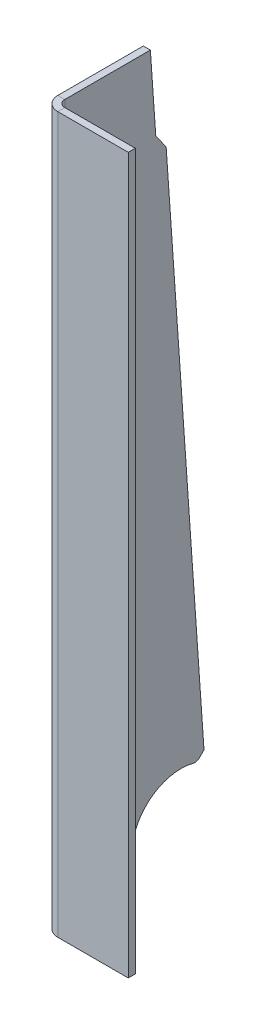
ISO-10303-21;
HEADER;
FILE_DESCRIPTION(('STEP AP214'),'2;1');
FILE_NAME('part.step','',(''),(''),'','','');
FILE_SCHEMA(('AUTOMOTIVE_DESIGN { 1 0 10303 214 1 1 1 1 }'));
ENDSEC;
DATA;
#1=APPLICATION_CONTEXT('core data for automotive mechanical design processes');
#2=APPLICATION_PROTOCOL_DEFINITION('international standard','automotive_design',2000,#1);
#3=PRODUCT_CONTEXT('',#1,'mechanical');
#4=PRODUCT('Part','Part','',(#3));
#5=PRODUCT_RELATED_PRODUCT_CATEGORY('part','',(#4));
#6=PRODUCT_DEFINITION_FORMATION('','',#4);
#7=PRODUCT_DEFINITION_CONTEXT('part definition',#1,'design');
#8=PRODUCT_DEFINITION('design','',#6,#7);
#9=PRODUCT_DEFINITION_SHAPE('','',#8);
#10=(LENGTH_UNIT() NAMED_UNIT(*) SI_UNIT(.MILLI.,.METRE.));
#11=(NAMED_UNIT(*) PLANE_ANGLE_UNIT() SI_UNIT($,.RADIAN.));
#12=(NAMED_UNIT(*) SI_UNIT($,.STERADIAN.) SOLID_ANGLE_UNIT());
#13=UNCERTAINTY_MEASURE_WITH_UNIT(LENGTH_MEASURE(1.E-05),#10,'distance_accuracy_value','');
#14=(GEOMETRIC_REPRESENTATION_CONTEXT(3) GLOBAL_UNCERTAINTY_ASSIGNED_CONTEXT((#13)) GLOBAL_UNIT_ASSIGNED_CONTEXT((#10,
#11,#12)) REPRESENTATION_CONTEXT('',''));
#15=CARTESIAN_POINT('',(0.,0.,0.));
#16=DIRECTION('',(0.,0.,1.));
#17=DIRECTION('',(1.,0.,0.));
#18=AXIS2_PLACEMENT_3D('',#15,#16,#17);
#19=CARTESIAN_POINT('',(6.34999999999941,644.525000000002,-138.112500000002));
#20=DIRECTION('',(1.,0.,0.));
#21=DIRECTION('',(0.,0.,-1.00000000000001));
#22=AXIS2_PLACEMENT_3D('',#19,#20,#21);
#23=PLANE('',#22);
#24=DIRECTION('',(0.,-0.707106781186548,0.707106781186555));
#25=VECTOR('',#24,1.);
#26=CARTESIAN_POINT('',(6.34999999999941,359.306056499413,-423.33144350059));
#27=LINE('',#26,#25);
#28=CARTESIAN_POINT('',(6.35000000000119,8.64303919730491,-72.6684261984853));
#29=VERTEX_POINT('',#28);
#30=CARTESIAN_POINT('',(6.34999999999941,0.,-64.0253870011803));
#31=VERTEX_POINT('',#30);
#32=EDGE_CURVE('E168',#29,#31,#27,.T.);
#33=ORIENTED_EDGE('',*,*,#32,.F.);
#34=CARTESIAN_POINT('',(6.34999999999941,13.1331672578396,-68.1782981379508));
#35=DIRECTION('',(1.,0.,0.));
#36=DIRECTION('',(0.,0.,-1.00000000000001));
#37=AXIS2_PLACEMENT_3D('',#34,#35,#36);
#38=CIRCLE('',#37,6.35);
#39=CARTESIAN_POINT('',(6.35000000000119,14.6665213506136,-74.3403858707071));
#40=VERTEX_POINT('',#39);
#41=EDGE_CURVE('E256',#29,#40,#38,.T.);
#42=ORIENTED_EDGE('',*,*,#41,.T.);
#43=CARTESIAN_POINT('',(6.35000000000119,25.4000000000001,-117.475000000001));
#44=DIRECTION('',(-1.,0.,0.));
#45=DIRECTION('',(0.,0.,1.00000000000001));
#46=AXIS2_PLACEMENT_3D('',#43,#44,#45);
#47=CIRCLE('',#46,44.45);
#48=CARTESIAN_POINT('',(6.35000000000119,68.534614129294,-128.208478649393));
#49=VERTEX_POINT('',#48);
#50=EDGE_CURVE('E277',#40,#49,#47,.T.);
#51=ORIENTED_EDGE('',*,*,#50,.T.);
#52=CARTESIAN_POINT('',(6.35000000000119,74.6967018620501,-129.741832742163));
#53=DIRECTION('',(1.,0.,0.));
#54=DIRECTION('',(0.,0.,-1.00000000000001));
#55=AXIS2_PLACEMENT_3D('',#52,#53,#54);
#56=CIRCLE('',#55,6.35);
#57=CARTESIAN_POINT('',(6.35000000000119,70.2065738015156,-134.231960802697));
#58=VERTEX_POINT('',#57);
#59=EDGE_CURVE('E254',#49,#58,#56,.T.);
#60=ORIENTED_EDGE('',*,*,#59,.T.);
#61=CARTESIAN_POINT('',(6.35000000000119,74.0871129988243,-138.112500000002));
#62=VERTEX_POINT('',#61);
#63=EDGE_CURVE('E167',#62,#58,#27,.T.);
#64=ORIENTED_EDGE('',*,*,#63,.F.);
#65=DIRECTION('',(0.,-0.997564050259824,-0.0697564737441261));
#66=VECTOR('',#65,1.);
#67=CARTESIAN_POINT('',(6.34999999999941,641.749268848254,-98.4176951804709));
#68=LINE('',#67,#66);
#69=CARTESIAN_POINT('',(6.34999999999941,562.002006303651,-103.994167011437));
#70=VERTEX_POINT('',#69);
#71=EDGE_CURVE('E155',#70,#62,#68,.T.);
#72=ORIENTED_EDGE('',*,*,#71,.F.);
#73=DIRECTION('',(0.,-0.809016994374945,-0.587785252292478));
#74=VECTOR('',#73,1.);
#75=CARTESIAN_POINT('',(6.34999999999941,599.789775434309,-76.5397456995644));
#76=LINE('',#75,#74);
#77=CARTESIAN_POINT('',(6.34999999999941,574.845151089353,-94.663076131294));
#78=VERTEX_POINT('',#77);
#79=EDGE_CURVE('E145',#78,#70,#76,.T.);
#80=ORIENTED_EDGE('',*,*,#79,.F.);
#81=DIRECTION('',(0.,-0.997564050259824,-0.0697564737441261));
#82=VECTOR('',#81,1.);
#83=CARTESIAN_POINT('',(6.34999999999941,641.162444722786,-90.0257192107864));
#84=LINE('',#83,#82);
#85=CARTESIAN_POINT('',(6.34999999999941,644.525000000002,-89.7905864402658));
#86=VERTEX_POINT('',#85);
#87=EDGE_CURVE('E156',#86,#78,#84,.T.);
#88=ORIENTED_EDGE('',*,*,#87,.F.);
#89=DIRECTION('',(0.,0.,1.00000000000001));
#90=VECTOR('',#89,1.);
#91=CARTESIAN_POINT('',(6.34999999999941,644.525000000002,-138.112500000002));
#92=LINE('',#91,#90);
#93=CARTESIAN_POINT('',(6.35000000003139,644.525000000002,-12.700000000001));
#94=VERTEX_POINT('',#93);
#95=EDGE_CURVE('E201',#86,#94,#92,.T.);
#96=ORIENTED_EDGE('',*,*,#95,.T.);
#97=DIRECTION('',(0.,-1.,0.));
#98=VECTOR('',#97,1.);
#99=CARTESIAN_POINT('',(6.35000000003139,644.525000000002,-12.700000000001));
#100=LINE('',#99,#98);
#101=CARTESIAN_POINT('',(6.34999999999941,3.99680288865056E-12,-12.7));
#102=VERTEX_POINT('',#101);
#103=EDGE_CURVE('E231',#94,#102,#100,.T.);
#104=ORIENTED_EDGE('',*,*,#103,.T.);
#105=DIRECTION('',(0.,0.,1.00000000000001));
#106=VECTOR('',#105,1.);
#107=CARTESIAN_POINT('',(6.35000000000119,3.99680288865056E-12,-138.112500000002));
#108=LINE('',#107,#106);
#109=EDGE_CURVE('E220',#31,#102,#108,.T.);
#110=ORIENTED_EDGE('',*,*,#109,.F.);
#111=EDGE_LOOP('',(#33,#42,#51,#60,#64,#72,#80,#88,#96,#104,#110));
#112=FACE_BOUND('',#111,.T.);
#113=ADVANCED_FACE('F36',(#112),#23,.T.);
#114=CARTESIAN_POINT('',(0.,644.525000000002,-138.1125));
#115=DIRECTION('',(1.,0.,0.));
#116=DIRECTION('',(0.,0.,-1.00000000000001));
#117=AXIS2_PLACEMENT_3D('',#114,#115,#116);
#118=PLANE('',#117);
#119=CARTESIAN_POINT('',(0.,25.4000000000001,-117.475));
#120=DIRECTION('',(-1.,0.,0.));
#121=DIRECTION('',(0.,0.,1.00000000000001));
#122=AXIS2_PLACEMENT_3D('',#119,#120,#121);
#123=CIRCLE('',#122,44.45);
#124=CARTESIAN_POINT('',(0.,14.6665213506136,-74.3403858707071));
#125=VERTEX_POINT('',#124);
#126=CARTESIAN_POINT('',(0.,68.534614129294,-128.208478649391));
#127=VERTEX_POINT('',#126);
#128=EDGE_CURVE('E266',#125,#127,#123,.T.);
#129=ORIENTED_EDGE('',*,*,#128,.F.);
#130=CARTESIAN_POINT('',(0.,13.1331672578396,-68.1782981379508));
#131=DIRECTION('',(1.,0.,0.));
#132=DIRECTION('',(0.,0.,-1.00000000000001));
#133=AXIS2_PLACEMENT_3D('',#130,#131,#132);
#134=CIRCLE('',#133,6.35);
#135=CARTESIAN_POINT('',(0.,8.64303919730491,-72.6684261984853));
#136=VERTEX_POINT('',#135);
#137=EDGE_CURVE('E44',#125,#136,#134,.F.);
#138=ORIENTED_EDGE('',*,*,#137,.T.);
#139=DIRECTION('',(0.,-0.707106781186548,0.707106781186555));
#140=VECTOR('',#139,1.);
#141=CARTESIAN_POINT('',(0.,359.306056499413,-423.331443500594));
#142=LINE('',#141,#140);
#143=CARTESIAN_POINT('',(0.,0.,-64.0253870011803));
#144=VERTEX_POINT('',#143);
#145=EDGE_CURVE('E182',#136,#144,#142,.T.);
#146=ORIENTED_EDGE('',*,*,#145,.T.);
#147=DIRECTION('',(0.,0.,1.00000000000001));
#148=VECTOR('',#147,1.);
#149=CARTESIAN_POINT('',(0.,3.99680288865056E-12,-138.112500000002));
#150=LINE('',#149,#148);
#151=CARTESIAN_POINT('',(0.,3.99680288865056E-12,-12.7));
#152=VERTEX_POINT('',#151);
#153=EDGE_CURVE('E222',#144,#152,#150,.T.);
#154=ORIENTED_EDGE('',*,*,#153,.T.);
#155=DIRECTION('',(0.,-1.,0.));
#156=VECTOR('',#155,1.);
#157=CARTESIAN_POINT('',(3.19744231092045E-11,644.525000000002,-12.700000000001));
#158=LINE('',#157,#156);
#159=CARTESIAN_POINT('',(3.19744231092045E-11,644.525000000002,-12.700000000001));
#160=VERTEX_POINT('',#159);
#161=EDGE_CURVE('E228',#160,#152,#158,.T.);
#162=ORIENTED_EDGE('',*,*,#161,.F.);
#163=DIRECTION('',(0.,0.,1.00000000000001));
#164=VECTOR('',#163,1.);
#165=CARTESIAN_POINT('',(0.,644.525000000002,-138.1125));
#166=LINE('',#165,#164);
#167=CARTESIAN_POINT('',(0.,644.525000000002,-89.7905864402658));
#168=VERTEX_POINT('',#167);
#169=EDGE_CURVE('E203',#168,#160,#166,.T.);
#170=ORIENTED_EDGE('',*,*,#169,.F.);
#171=DIRECTION('',(0.,-0.997564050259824,-0.0697564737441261));
#172=VECTOR('',#171,1.);
#173=CARTESIAN_POINT('',(0.,641.162444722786,-90.0257192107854));
#174=LINE('',#173,#172);
#175=CARTESIAN_POINT('',(0.,574.845151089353,-94.663076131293));
#176=VERTEX_POINT('',#175);
#177=EDGE_CURVE('E174',#168,#176,#174,.T.);
#178=ORIENTED_EDGE('',*,*,#177,.T.);
#179=DIRECTION('',(0.,-0.809016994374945,-0.587785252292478));
#180=VECTOR('',#179,1.);
#181=CARTESIAN_POINT('',(0.,599.789775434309,-76.5397456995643));
#182=LINE('',#181,#180);
#183=CARTESIAN_POINT('',(0.,562.002006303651,-103.994167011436));
#184=VERTEX_POINT('',#183);
#185=EDGE_CURVE('E163',#176,#184,#182,.T.);
#186=ORIENTED_EDGE('',*,*,#185,.T.);
#187=DIRECTION('',(0.,-0.997564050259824,-0.0697564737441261));
#188=VECTOR('',#187,1.);
#189=CARTESIAN_POINT('',(0.,641.749268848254,-98.4176951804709));
#190=LINE('',#189,#188);
#191=CARTESIAN_POINT('',(0.,74.0871129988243,-138.1125));
#192=VERTEX_POINT('',#191);
#193=EDGE_CURVE('E162',#184,#192,#190,.T.);
#194=ORIENTED_EDGE('',*,*,#193,.T.);
#195=CARTESIAN_POINT('',(0.,70.2065738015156,-134.231960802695));
#196=VERTEX_POINT('',#195);
#197=EDGE_CURVE('E180',#192,#196,#142,.T.);
#198=ORIENTED_EDGE('',*,*,#197,.T.);
#199=CARTESIAN_POINT('',(0.,74.6967018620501,-129.741832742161));
#200=DIRECTION('',(1.,0.,0.));
#201=DIRECTION('',(0.,0.,-1.00000000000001));
#202=AXIS2_PLACEMENT_3D('',#199,#200,#201);
#203=CIRCLE('',#202,6.35);
#204=EDGE_CURVE('E56',#196,#127,#203,.F.);
#205=ORIENTED_EDGE('',*,*,#204,.T.);
#206=EDGE_LOOP('',(#129,#138,#146,#154,#162,#170,#178,#186,#194,#198,#205));
#207=FACE_BOUND('',#206,.T.);
#208=ADVANCED_FACE('F265',(#207),#118,.F.);
#209=CARTESIAN_POINT('',(6.34999999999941,359.306056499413,-423.33144350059));
#210=DIRECTION('',(0.,0.707106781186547,0.707106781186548));
#211=DIRECTION('',(0.,-0.707106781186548,0.707106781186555));
#212=AXIS2_PLACEMENT_3D('',#209,#210,#211);
#213=PLANE('',#212);
#214=ORIENTED_EDGE('',*,*,#63,.T.);
#215=DIRECTION('',(1.,0.,0.));
#216=VECTOR('',#215,1.);
#217=CARTESIAN_POINT('',(6.35000000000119,70.2065738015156,-134.231960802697));
#218=LINE('',#217,#216);
#219=EDGE_CURVE('E11',#58,#196,#218,.F.);
#220=ORIENTED_EDGE('',*,*,#219,.T.);
#221=ORIENTED_EDGE('',*,*,#197,.F.);
#222=DIRECTION('',(1.,0.,0.));
#223=VECTOR('',#222,1.);
#224=CARTESIAN_POINT('',(6.35000000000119,74.0871129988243,-138.112500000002));
#225=LINE('',#224,#223);
#226=EDGE_CURVE('E181',#62,#192,#225,.F.);
#227=ORIENTED_EDGE('',*,*,#226,.F.);
#228=EDGE_LOOP('',(#214,#220,#221,#227));
#229=FACE_BOUND('',#228,.T.);
#230=ADVANCED_FACE('F322',(#229),#213,.F.);
#231=ORIENTED_EDGE('',*,*,#145,.F.);
#232=DIRECTION('',(1.,0.,0.));
#233=VECTOR('',#232,1.);
#234=CARTESIAN_POINT('',(6.35000000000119,8.64303919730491,-72.6684261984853));
#235=LINE('',#234,#233);
#236=EDGE_CURVE('E251',#136,#29,#235,.T.);
#237=ORIENTED_EDGE('',*,*,#236,.T.);
#238=ORIENTED_EDGE('',*,*,#32,.T.);
#239=DIRECTION('',(1.,0.,0.));
#240=VECTOR('',#239,1.);
#241=CARTESIAN_POINT('',(6.34999999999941,0.,-64.0253870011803));
#242=LINE('',#241,#240);
#243=EDGE_CURVE('E184',#31,#144,#242,.F.);
#244=ORIENTED_EDGE('',*,*,#243,.T.);
#245=EDGE_LOOP('',(#231,#237,#238,#244));
#246=FACE_BOUND('',#245,.T.);
#247=ADVANCED_FACE('F271',(#246),#213,.F.);
#248=CARTESIAN_POINT('',(12.7000000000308,644.525000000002,-6.35000000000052));
#249=DIRECTION('',(0.,1.,0.));
#250=DIRECTION('',(0.,0.,1.00000000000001));
#251=AXIS2_PLACEMENT_3D('',#248,#249,#250);
#252=PLANE('',#251);
#253=ORIENTED_EDGE('',*,*,#95,.F.);
#254=DIRECTION('',(1.,0.,0.));
#255=VECTOR('',#254,1.);
#256=CARTESIAN_POINT('',(6.34999999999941,644.525000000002,-89.7905864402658));
#257=LINE('',#256,#255);
#258=EDGE_CURVE('E177',#86,#168,#257,.F.);
#259=ORIENTED_EDGE('',*,*,#258,.T.);
#260=ORIENTED_EDGE('',*,*,#169,.T.);
#261=DIRECTION('',(1.,0.,0.));
#262=VECTOR('',#261,1.);
#263=CARTESIAN_POINT('',(3.19744231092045E-11,644.525000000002,-12.700000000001));
#264=LINE('',#263,#262);
#265=EDGE_CURVE('E248',#160,#94,#264,.T.);
#266=ORIENTED_EDGE('',*,*,#265,.T.);
#267=EDGE_LOOP('',(#253,#259,#260,#266));
#268=FACE_BOUND('',#267,.T.);
#269=ADVANCED_FACE('F289',(#268),#252,.T.);
#270=CARTESIAN_POINT('',(12.7000000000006,3.99680288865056E-12,-12.7));
#271=DIRECTION('',(0.,1.,0.));
#272=DIRECTION('',(1.,0.,0.));
#273=AXIS2_PLACEMENT_3D('',#270,#271,#272);
#274=PLANE('',#273);
#275=ORIENTED_EDGE('',*,*,#243,.F.);
#276=ORIENTED_EDGE('',*,*,#109,.T.);
#277=DIRECTION('',(-1.,0.,0.));
#278=VECTOR('',#277,1.);
#279=CARTESIAN_POINT('',(6.34999999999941,3.99680288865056E-12,-12.7));
#280=LINE('',#279,#278);
#281=EDGE_CURVE('E241',#102,#152,#280,.T.);
#282=ORIENTED_EDGE('',*,*,#281,.T.);
#283=ORIENTED_EDGE('',*,*,#153,.F.);
#284=EDGE_LOOP('',(#275,#276,#282,#283));
#285=FACE_BOUND('',#284,.T.);
#286=ADVANCED_FACE('F350',(#285),#274,.F.);
#287=CARTESIAN_POINT('',(3.19744231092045E-11,644.525000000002,-12.700000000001));
#288=DIRECTION('',(0.,1.,0.));
#289=DIRECTION('',(0.,0.,1.00000000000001));
#290=AXIS2_PLACEMENT_3D('',#287,#288,#289);
#291=PLANE('',#290);
#292=ORIENTED_EDGE('',*,*,#265,.F.);
#293=CARTESIAN_POINT('',(12.7000000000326,644.525,-12.700000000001));
#294=DIRECTION('',(0.,-1.,0.));
#295=DIRECTION('',(0.,0.,-1.00000000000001));
#296=AXIS2_PLACEMENT_3D('',#293,#294,#295);
#297=CIRCLE('',#296,12.7);
#298=CARTESIAN_POINT('',(12.7000000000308,644.525,-4.9960036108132E-13));
#299=VERTEX_POINT('',#298);
#300=EDGE_CURVE('E205',#160,#299,#297,.F.);
#301=ORIENTED_EDGE('',*,*,#300,.T.);
#302=DIRECTION('',(0.,0.,1.00000000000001));
#303=VECTOR('',#302,1.);
#304=CARTESIAN_POINT('',(12.7000000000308,644.525000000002,-6.35000000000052));
#305=LINE('',#304,#303);
#306=CARTESIAN_POINT('',(12.7000000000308,644.525000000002,-6.35000000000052));
#307=VERTEX_POINT('',#306);
#308=EDGE_CURVE('E246',#307,#299,#305,.T.);
#309=ORIENTED_EDGE('',*,*,#308,.F.);
#310=CARTESIAN_POINT('',(12.7000000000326,644.525,-12.700000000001));
#311=DIRECTION('',(0.,1.,0.));
#312=DIRECTION('',(1.,0.,0.));
#313=AXIS2_PLACEMENT_3D('',#310,#311,#312);
#314=CIRCLE('',#313,6.35);
#315=EDGE_CURVE('E198',#94,#307,#314,.T.);
#316=ORIENTED_EDGE('',*,*,#315,.F.);
#317=EDGE_LOOP('',(#292,#301,#309,#316));
#318=FACE_BOUND('',#317,.T.);
#319=ADVANCED_FACE('F300',(#318),#291,.T.);
#320=CARTESIAN_POINT('',(12.7000000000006,0.,0.));
#321=DIRECTION('',(0.,-1.,0.));
#322=DIRECTION('',(0.,0.,-1.00000000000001));
#323=AXIS2_PLACEMENT_3D('',#320,#321,#322);
#324=PLANE('',#323);
#325=DIRECTION('',(0.,0.,-1.00000000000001));
#326=VECTOR('',#325,1.);
#327=CARTESIAN_POINT('',(12.7000000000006,0.,0.));
#328=LINE('',#327,#326);
#329=CARTESIAN_POINT('',(12.7000000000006,0.,0.));
#330=VERTEX_POINT('',#329);
#331=CARTESIAN_POINT('',(12.7000000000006,0.,-6.34999999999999));
#332=VERTEX_POINT('',#331);
#333=EDGE_CURVE('E244',#330,#332,#328,.T.);
#334=ORIENTED_EDGE('',*,*,#333,.F.);
#335=CARTESIAN_POINT('',(12.7000000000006,3.99680288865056E-12,-12.7));
#336=DIRECTION('',(0.,-1.,0.));
#337=DIRECTION('',(0.,0.,-1.00000000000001));
#338=AXIS2_PLACEMENT_3D('',#335,#336,#337);
#339=CIRCLE('',#338,12.7);
#340=EDGE_CURVE('E192',#152,#330,#339,.F.);
#341=ORIENTED_EDGE('',*,*,#340,.F.);
#342=ORIENTED_EDGE('',*,*,#281,.F.);
#343=CARTESIAN_POINT('',(12.7000000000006,3.99680288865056E-12,-12.7));
#344=DIRECTION('',(0.,1.,0.));
#345=DIRECTION('',(1.,0.,0.));
#346=AXIS2_PLACEMENT_3D('',#343,#344,#345);
#347=CIRCLE('',#346,6.35);
#348=EDGE_CURVE('E217',#102,#332,#347,.T.);
#349=ORIENTED_EDGE('',*,*,#348,.T.);
#350=EDGE_LOOP('',(#334,#341,#342,#349));
#351=FACE_BOUND('',#350,.T.);
#352=ADVANCED_FACE('F343',(#351),#324,.T.);
#353=CARTESIAN_POINT('',(6.34999999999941,3.99680288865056E-12,-12.7));
#354=DIRECTION('',(0.,-1.,0.));
#355=DIRECTION('',(0.,0.,-1.00000000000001));
#356=AXIS2_PLACEMENT_3D('',#353,#354,#355);
#357=PLANE('',#356);
#358=DIRECTION('',(1.,0.,0.));
#359=VECTOR('',#358,1.);
#360=CARTESIAN_POINT('',(0.,0.,0.));
#361=LINE('',#360,#359);
#362=CARTESIAN_POINT('',(76.2,0.,0.));
#363=VERTEX_POINT('',#362);
#364=EDGE_CURVE('E187',#330,#363,#361,.T.);
#365=ORIENTED_EDGE('',*,*,#364,.F.);
#366=ORIENTED_EDGE('',*,*,#333,.T.);
#367=DIRECTION('',(1.,0.,0.));
#368=VECTOR('',#367,1.);
#369=CARTESIAN_POINT('',(0.,0.,-6.34999999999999));
#370=LINE('',#369,#368);
#371=CARTESIAN_POINT('',(76.2,0.,-6.34999999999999));
#372=VERTEX_POINT('',#371);
#373=EDGE_CURVE('E214',#332,#372,#370,.T.);
#374=ORIENTED_EDGE('',*,*,#373,.T.);
#375=DIRECTION('',(0.,0.,1.00000000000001));
#376=VECTOR('',#375,1.);
#377=CARTESIAN_POINT('',(76.2,0.,-6.34999999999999));
#378=LINE('',#377,#376);
#379=EDGE_CURVE('E211',#372,#363,#378,.T.);
#380=ORIENTED_EDGE('',*,*,#379,.T.);
#381=EDGE_LOOP('',(#365,#366,#374,#380));
#382=FACE_BOUND('',#381,.T.);
#383=ADVANCED_FACE('F339',(#382),#357,.T.);
#384=CARTESIAN_POINT('',(3.19744231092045E-11,644.525000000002,-4.9960036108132E-13));
#385=DIRECTION('',(0.,0.,-1.00000000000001));
#386=DIRECTION('',(-1.,0.,0.));
#387=AXIS2_PLACEMENT_3D('',#384,#385,#386);
#388=PLANE('',#387);
#389=ORIENTED_EDGE('',*,*,#364,.T.);
#390=DIRECTION('',(0.,-1.,0.));
#391=VECTOR('',#390,1.);
#392=CARTESIAN_POINT('',(76.200000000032,644.525,-4.9960036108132E-13));
#393=LINE('',#392,#391);
#394=CARTESIAN_POINT('',(76.200000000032,644.525,-4.9960036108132E-13));
#395=VERTEX_POINT('',#394);
#396=EDGE_CURVE('E239',#395,#363,#393,.T.);
#397=ORIENTED_EDGE('',*,*,#396,.F.);
#398=DIRECTION('',(1.,0.,0.));
#399=VECTOR('',#398,1.);
#400=CARTESIAN_POINT('',(3.19744231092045E-11,644.525000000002,-4.9960036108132E-13));
#401=LINE('',#400,#399);
#402=EDGE_CURVE('E189',#299,#395,#401,.T.);
#403=ORIENTED_EDGE('',*,*,#402,.F.);
#404=DIRECTION('',(0.,-1.,0.));
#405=VECTOR('',#404,1.);
#406=CARTESIAN_POINT('',(12.7000000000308,644.525,-4.9960036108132E-13));
#407=LINE('',#406,#405);
#408=EDGE_CURVE('E208',#299,#330,#407,.T.);
#409=ORIENTED_EDGE('',*,*,#408,.T.);
#410=EDGE_LOOP('',(#389,#397,#403,#409));
#411=FACE_BOUND('',#410,.T.);
#412=ADVANCED_FACE('F335',(#411),#388,.F.);
#413=CARTESIAN_POINT('',(76.200000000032,644.525000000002,-6.35000000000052));
#414=DIRECTION('',(1.,0.,0.));
#415=DIRECTION('',(0.,0.,-1.00000000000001));
#416=AXIS2_PLACEMENT_3D('',#413,#414,#415);
#417=PLANE('',#416);
#418=ORIENTED_EDGE('',*,*,#379,.F.);
#419=DIRECTION('',(0.,-1.,0.));
#420=VECTOR('',#419,1.);
#421=CARTESIAN_POINT('',(76.200000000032,644.525000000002,-6.35000000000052));
#422=LINE('',#421,#420);
#423=CARTESIAN_POINT('',(76.200000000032,644.525000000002,-6.35000000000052));
#424=VERTEX_POINT('',#423);
#425=EDGE_CURVE('E237',#424,#372,#422,.T.);
#426=ORIENTED_EDGE('',*,*,#425,.F.);
#427=DIRECTION('',(0.,0.,1.00000000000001));
#428=VECTOR('',#427,1.);
#429=CARTESIAN_POINT('',(76.200000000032,644.525000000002,-6.35000000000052));
#430=LINE('',#429,#428);
#431=EDGE_CURVE('E191',#424,#395,#430,.T.);
#432=ORIENTED_EDGE('',*,*,#431,.T.);
#433=ORIENTED_EDGE('',*,*,#396,.T.);
#434=EDGE_LOOP('',(#418,#426,#432,#433));
#435=FACE_BOUND('',#434,.T.);
#436=ADVANCED_FACE('F331',(#435),#417,.T.);
#437=CARTESIAN_POINT('',(3.19744231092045E-11,644.525000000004,-6.35000000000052));
#438=DIRECTION('',(0.,0.,-1.00000000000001));
#439=DIRECTION('',(-1.,0.,0.));
#440=AXIS2_PLACEMENT_3D('',#437,#438,#439);
#441=PLANE('',#440);
#442=ORIENTED_EDGE('',*,*,#373,.F.);
#443=DIRECTION('',(0.,-1.,0.));
#444=VECTOR('',#443,1.);
#445=CARTESIAN_POINT('',(12.7000000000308,644.525000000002,-6.35000000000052));
#446=LINE('',#445,#444);
#447=EDGE_CURVE('E234',#307,#332,#446,.T.);
#448=ORIENTED_EDGE('',*,*,#447,.F.);
#449=DIRECTION('',(1.,0.,0.));
#450=VECTOR('',#449,1.);
#451=CARTESIAN_POINT('',(3.19744231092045E-11,644.525000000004,-6.35000000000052));
#452=LINE('',#451,#450);
#453=EDGE_CURVE('E195',#307,#424,#452,.T.);
#454=ORIENTED_EDGE('',*,*,#453,.T.);
#455=ORIENTED_EDGE('',*,*,#425,.T.);
#456=EDGE_LOOP('',(#442,#448,#454,#455));
#457=FACE_BOUND('',#456,.T.);
#458=ADVANCED_FACE('F328',(#457),#441,.T.);
#459=CARTESIAN_POINT('',(12.7000000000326,644.525,-12.700000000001));
#460=DIRECTION('',(0.,-1.,0.));
#461=DIRECTION('',(0.,0.,-1.00000000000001));
#462=AXIS2_PLACEMENT_3D('',#459,#460,#461);
#463=CYLINDRICAL_SURFACE('',#462,6.35);
#464=ORIENTED_EDGE('',*,*,#348,.F.);
#465=ORIENTED_EDGE('',*,*,#103,.F.);
#466=ORIENTED_EDGE('',*,*,#315,.T.);
#467=ORIENTED_EDGE('',*,*,#447,.T.);
#468=EDGE_LOOP('',(#464,#465,#466,#467));
#469=FACE_BOUND('',#468,.T.);
#470=ADVANCED_FACE('F306',(#469),#463,.F.);
#471=CARTESIAN_POINT('',(12.7000000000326,644.525,-12.700000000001));
#472=DIRECTION('',(0.,-1.,0.));
#473=DIRECTION('',(0.,0.,-1.00000000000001));
#474=AXIS2_PLACEMENT_3D('',#471,#472,#473);
#475=CYLINDRICAL_SURFACE('',#474,12.7);
#476=ORIENTED_EDGE('',*,*,#340,.T.);
#477=ORIENTED_EDGE('',*,*,#408,.F.);
#478=ORIENTED_EDGE('',*,*,#300,.F.);
#479=ORIENTED_EDGE('',*,*,#161,.T.);
#480=EDGE_LOOP('',(#476,#477,#478,#479));
#481=FACE_BOUND('',#480,.T.);
#482=ADVANCED_FACE('F297',(#481),#475,.T.);
#483=CARTESIAN_POINT('',(12.7000000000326,644.525,-12.700000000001));
#484=DIRECTION('',(0.,1.,0.));
#485=DIRECTION('',(1.,0.,0.));
#486=AXIS2_PLACEMENT_3D('',#483,#484,#485);
#487=PLANE('',#486);
#488=ORIENTED_EDGE('',*,*,#402,.T.);
#489=ORIENTED_EDGE('',*,*,#431,.F.);
#490=ORIENTED_EDGE('',*,*,#453,.F.);
#491=ORIENTED_EDGE('',*,*,#308,.T.);
#492=EDGE_LOOP('',(#488,#489,#490,#491));
#493=FACE_BOUND('',#492,.T.);
#494=ADVANCED_FACE('F365',(#493),#487,.T.);
#495=CARTESIAN_POINT('',(6.34999999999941,599.789775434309,-76.5397456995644));
#496=DIRECTION('',(0.,-0.587785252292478,0.809016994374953));
#497=DIRECTION('',(0.,-0.809016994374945,-0.587785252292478));
#498=AXIS2_PLACEMENT_3D('',#495,#496,#497);
#499=PLANE('',#498);
#500=DIRECTION('',(1.,0.,0.));
#501=VECTOR('',#500,1.);
#502=CARTESIAN_POINT('',(6.34999999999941,574.845151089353,-94.663076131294));
#503=LINE('',#502,#501);
#504=EDGE_CURVE('E151',#78,#176,#503,.F.);
#505=ORIENTED_EDGE('',*,*,#504,.F.);
#506=ORIENTED_EDGE('',*,*,#79,.T.);
#507=DIRECTION('',(1.,0.,0.));
#508=VECTOR('',#507,1.);
#509=CARTESIAN_POINT('',(6.34999999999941,562.002006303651,-103.994167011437));
#510=LINE('',#509,#508);
#511=EDGE_CURVE('E148',#70,#184,#510,.F.);
#512=ORIENTED_EDGE('',*,*,#511,.T.);
#513=ORIENTED_EDGE('',*,*,#185,.F.);
#514=EDGE_LOOP('',(#505,#506,#512,#513));
#515=FACE_BOUND('',#514,.T.);
#516=ADVANCED_FACE('F147',(#515),#499,.F.);
#517=CARTESIAN_POINT('',(6.34999999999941,641.749268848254,-98.4176951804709));
#518=DIRECTION('',(0.,-0.0697564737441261,0.997564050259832));
#519=DIRECTION('',(0.,-0.997564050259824,-0.0697564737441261));
#520=AXIS2_PLACEMENT_3D('',#517,#518,#519);
#521=PLANE('',#520);
#522=ORIENTED_EDGE('',*,*,#511,.F.);
#523=ORIENTED_EDGE('',*,*,#71,.T.);
#524=ORIENTED_EDGE('',*,*,#226,.T.);
#525=ORIENTED_EDGE('',*,*,#193,.F.);
#526=EDGE_LOOP('',(#522,#523,#524,#525));
#527=FACE_BOUND('',#526,.T.);
#528=ADVANCED_FACE('F159',(#527),#521,.F.);
#529=CARTESIAN_POINT('',(6.34999999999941,641.162444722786,-90.0257192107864));
#530=DIRECTION('',(0.,-0.0697564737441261,0.997564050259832));
#531=DIRECTION('',(0.,-0.997564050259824,-0.0697564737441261));
#532=AXIS2_PLACEMENT_3D('',#529,#530,#531);
#533=PLANE('',#532);
#534=ORIENTED_EDGE('',*,*,#87,.T.);
#535=ORIENTED_EDGE('',*,*,#504,.T.);
#536=ORIENTED_EDGE('',*,*,#177,.F.);
#537=ORIENTED_EDGE('',*,*,#258,.F.);
#538=EDGE_LOOP('',(#534,#535,#536,#537));
#539=FACE_BOUND('',#538,.T.);
#540=ADVANCED_FACE('F307',(#539),#533,.F.);
#541=CARTESIAN_POINT('',(0.,25.4000000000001,-117.475));
#542=DIRECTION('',(-1.,0.,0.));
#543=DIRECTION('',(0.,0.,1.00000000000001));
#544=AXIS2_PLACEMENT_3D('',#541,#542,#543);
#545=CYLINDRICAL_SURFACE('',#544,44.45);
#546=ORIENTED_EDGE('',*,*,#50,.F.);
#547=DIRECTION('',(-1.,0.,0.));
#548=VECTOR('',#547,1.);
#549=CARTESIAN_POINT('',(0.,14.6665213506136,-74.3403858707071));
#550=LINE('',#549,#548);
#551=EDGE_CURVE('E261',#40,#125,#550,.T.);
#552=ORIENTED_EDGE('',*,*,#551,.T.);
#553=ORIENTED_EDGE('',*,*,#128,.T.);
#554=DIRECTION('',(-1.,0.,0.));
#555=VECTOR('',#554,1.);
#556=CARTESIAN_POINT('',(0.,68.534614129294,-128.208478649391));
#557=LINE('',#556,#555);
#558=EDGE_CURVE('E258',#127,#49,#557,.F.);
#559=ORIENTED_EDGE('',*,*,#558,.T.);
#560=EDGE_LOOP('',(#546,#552,#553,#559));
#561=FACE_BOUND('',#560,.T.);
#562=ADVANCED_FACE('F280',(#561),#545,.F.);
#563=CARTESIAN_POINT('',(0.,13.1331672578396,-68.1782981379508));
#564=DIRECTION('',(-1.,0.,0.));
#565=DIRECTION('',(0.,0.,1.00000000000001));
#566=AXIS2_PLACEMENT_3D('',#563,#564,#565);
#567=CYLINDRICAL_SURFACE('',#566,6.35);
#568=ORIENTED_EDGE('',*,*,#137,.F.);
#569=ORIENTED_EDGE('',*,*,#551,.F.);
#570=ORIENTED_EDGE('',*,*,#41,.F.);
#571=ORIENTED_EDGE('',*,*,#236,.F.);
#572=EDGE_LOOP('',(#568,#569,#570,#571));
#573=FACE_BOUND('',#572,.T.);
#574=ADVANCED_FACE('F274',(#573),#567,.T.);
#575=CARTESIAN_POINT('',(0.,74.6967018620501,-129.741832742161));
#576=DIRECTION('',(-1.,0.,0.));
#577=DIRECTION('',(0.,0.,1.00000000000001));
#578=AXIS2_PLACEMENT_3D('',#575,#576,#577);
#579=CYLINDRICAL_SURFACE('',#578,6.35);
#580=ORIENTED_EDGE('',*,*,#204,.F.);
#581=ORIENTED_EDGE('',*,*,#219,.F.);
#582=ORIENTED_EDGE('',*,*,#59,.F.);
#583=ORIENTED_EDGE('',*,*,#558,.F.);
#584=EDGE_LOOP('',(#580,#581,#582,#583));
#585=FACE_BOUND('',#584,.T.);
#586=ADVANCED_FACE('F38',(#585),#579,.T.);
#587=CLOSED_SHELL('',(#113,#208,#230,#247,#269,#286,#319,#352,#383,#412,#436,#458,#470,#482,
#494,#516,#528,#540,#562,#574,#586));
#588=MANIFOLD_SOLID_BREP('B2',#587);
#589=ADVANCED_BREP_SHAPE_REPRESENTATION('',(#18,#588),#14);
#590=SHAPE_DEFINITION_REPRESENTATION(#9,#589);
ENDSEC;
END-ISO-10303-21;
